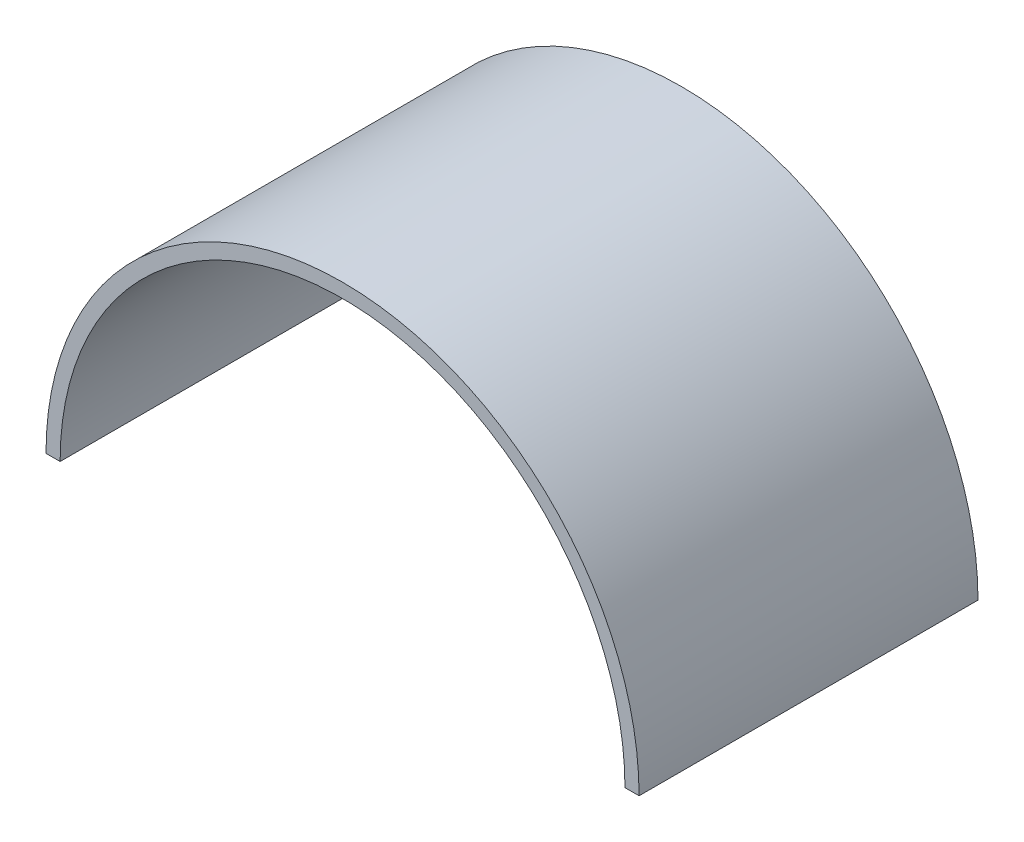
from build123d import *

# Parameters (mm, degrees)
BOSS_EXTRUDE1_DEPTH = 76.2


with BuildPart() as part:
    # Sketch1 → Boss-Extrude1 (new body)
    with BuildSketch(Plane.XY):
        with BuildLine():
            Line((-55.372, 109.22), (-52.197, 109.22))
            ThreePointArc((-52.197, 109.22), (-118.872, 175.895), (-185.547, 109.22))
            Line((-185.547, 109.22), (-182.372, 109.22))
            ThreePointArc((-182.372, 109.22), (-118.872, 172.72), (-55.372, 109.22))
        make_face()
    extrude(amount=BOSS_EXTRUDE1_DEPTH)


solid = part.part
